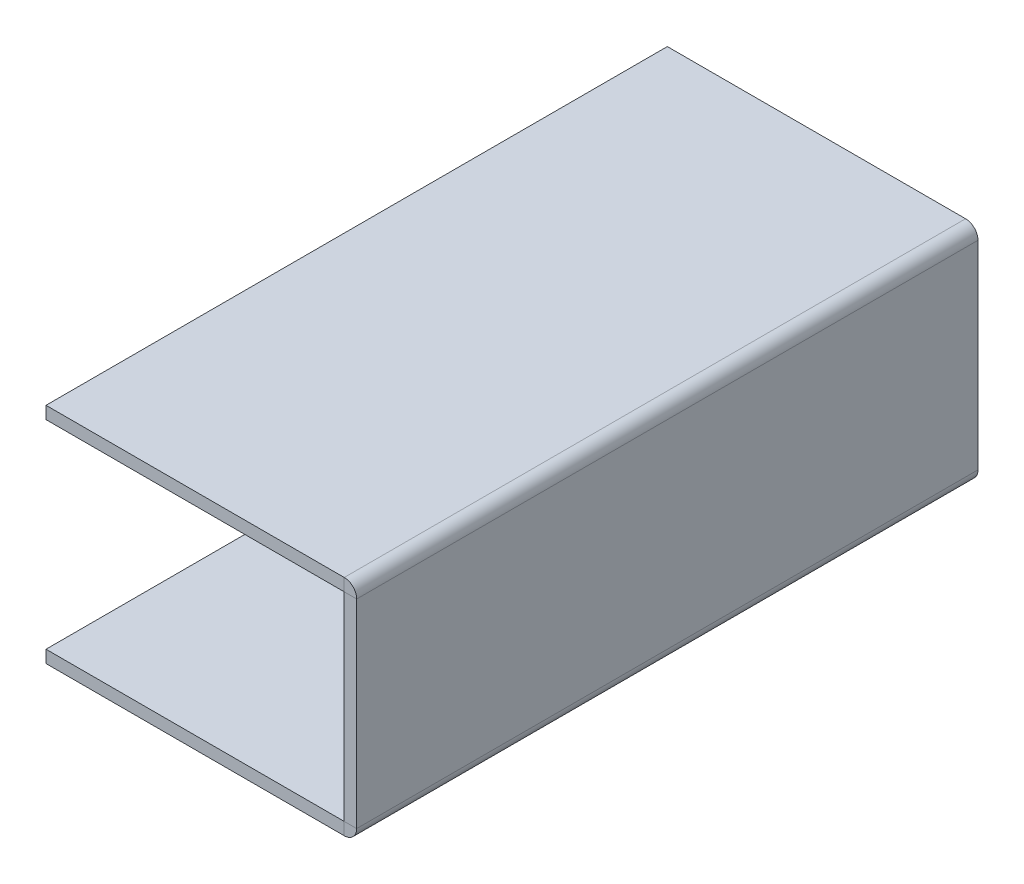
ISO-10303-21;
HEADER;
FILE_DESCRIPTION(('STEP AP214'),'2;1');
FILE_NAME('part.step','',(''),(''),'','','');
FILE_SCHEMA(('AUTOMOTIVE_DESIGN { 1 0 10303 214 1 1 1 1 }'));
ENDSEC;
DATA;
#1=APPLICATION_CONTEXT('core data for automotive mechanical design processes');
#2=APPLICATION_PROTOCOL_DEFINITION('international standard','automotive_design',2000,#1);
#3=PRODUCT_CONTEXT('',#1,'mechanical');
#4=PRODUCT('Part','Part','',(#3));
#5=PRODUCT_RELATED_PRODUCT_CATEGORY('part','',(#4));
#6=PRODUCT_DEFINITION_FORMATION('','',#4);
#7=PRODUCT_DEFINITION_CONTEXT('part definition',#1,'design');
#8=PRODUCT_DEFINITION('design','',#6,#7);
#9=PRODUCT_DEFINITION_SHAPE('','',#8);
#10=(LENGTH_UNIT() NAMED_UNIT(*) SI_UNIT(.MILLI.,.METRE.));
#11=(NAMED_UNIT(*) PLANE_ANGLE_UNIT() SI_UNIT($,.RADIAN.));
#12=(NAMED_UNIT(*) SI_UNIT($,.STERADIAN.) SOLID_ANGLE_UNIT());
#13=UNCERTAINTY_MEASURE_WITH_UNIT(LENGTH_MEASURE(1.E-05),#10,'distance_accuracy_value','');
#14=(GEOMETRIC_REPRESENTATION_CONTEXT(3) GLOBAL_UNCERTAINTY_ASSIGNED_CONTEXT((#13)) GLOBAL_UNIT_ASSIGNED_CONTEXT((#10,
#11,#12)) REPRESENTATION_CONTEXT('',''));
#15=CARTESIAN_POINT('',(0.,0.,0.));
#16=DIRECTION('',(0.,0.,1.));
#17=DIRECTION('',(1.,0.,0.));
#18=AXIS2_PLACEMENT_3D('',#15,#16,#17);
#19=CARTESIAN_POINT('',(24.0001000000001,24.0000727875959,-50.));
#20=DIRECTION('',(-1.,0.,0.));
#21=DIRECTION('',(0.,0.,-1.));
#22=AXIS2_PLACEMENT_3D('',#19,#20,#21);
#23=PLANE('',#22);
#24=DIRECTION('',(0.,1.,0.));
#25=VECTOR('',#24,1.);
#26=CARTESIAN_POINT('',(24.0001000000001,24.0000727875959,-50.));
#27=LINE('',#26,#25);
#28=CARTESIAN_POINT('',(24.0000999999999,-15.9999272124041,-50.));
#29=VERTEX_POINT('',#28);
#30=CARTESIAN_POINT('',(24.0001,-9.99999999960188E-05,-50.));
#31=VERTEX_POINT('',#30);
#32=EDGE_CURVE('E58',#29,#31,#27,.T.);
#33=ORIENTED_EDGE('',*,*,#32,.F.);
#34=DIRECTION('',(0.,0.,1.));
#35=VECTOR('',#34,1.);
#36=CARTESIAN_POINT('',(24.0000999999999,-15.9999272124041,-50.));
#37=LINE('',#36,#35);
#38=CARTESIAN_POINT('',(24.0001,-15.9999272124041,0.));
#39=VERTEX_POINT('',#38);
#40=EDGE_CURVE('E50',#29,#39,#37,.T.);
#41=ORIENTED_EDGE('',*,*,#40,.T.);
#42=DIRECTION('',(0.,-1.,0.));
#43=VECTOR('',#42,1.);
#44=CARTESIAN_POINT('',(24.0001000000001,24.000072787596,0.));
#45=LINE('',#44,#43);
#46=CARTESIAN_POINT('',(24.0001,-9.99999999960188E-05,0.));
#47=VERTEX_POINT('',#46);
#48=EDGE_CURVE('E66',#47,#39,#45,.T.);
#49=ORIENTED_EDGE('',*,*,#48,.F.);
#50=DIRECTION('',(0.,0.,1.));
#51=VECTOR('',#50,1.);
#52=CARTESIAN_POINT('',(24.0001,-9.99999999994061E-05,-50.));
#53=LINE('',#52,#51);
#54=EDGE_CURVE('E226',#31,#47,#53,.T.);
#55=ORIENTED_EDGE('',*,*,#54,.F.);
#56=EDGE_LOOP('',(#33,#41,#49,#55));
#57=FACE_BOUND('',#56,.T.);
#58=ADVANCED_FACE('F41',(#57),#23,.T.);
#59=CARTESIAN_POINT('',(25.0001000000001,24.000072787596,0.));
#60=DIRECTION('',(0.,0.,-1.));
#61=DIRECTION('',(0.,1.,0.));
#62=AXIS2_PLACEMENT_3D('',#59,#60,#61);
#63=PLANE('',#62);
#64=DIRECTION('',(-1.,0.,0.));
#65=VECTOR('',#64,1.);
#66=CARTESIAN_POINT('',(25.0001,-15.9999272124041,0.));
#67=LINE('',#66,#65);
#68=CARTESIAN_POINT('',(25.0001,-15.9999272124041,0.));
#69=VERTEX_POINT('',#68);
#70=EDGE_CURVE('E233',#69,#39,#67,.T.);
#71=ORIENTED_EDGE('',*,*,#70,.F.);
#72=DIRECTION('',(0.,-1.,0.));
#73=VECTOR('',#72,1.);
#74=CARTESIAN_POINT('',(25.0001000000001,24.000072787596,0.));
#75=LINE('',#74,#73);
#76=CARTESIAN_POINT('',(25.0001,-0.000100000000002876,0.));
#77=VERTEX_POINT('',#76);
#78=EDGE_CURVE('E238',#77,#69,#75,.T.);
#79=ORIENTED_EDGE('',*,*,#78,.F.);
#80=DIRECTION('',(-1.,0.,0.));
#81=VECTOR('',#80,1.);
#82=CARTESIAN_POINT('',(25.0001,-0.000100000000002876,0.));
#83=LINE('',#82,#81);
#84=EDGE_CURVE('E228',#77,#47,#83,.T.);
#85=ORIENTED_EDGE('',*,*,#84,.T.);
#86=ORIENTED_EDGE('',*,*,#48,.T.);
#87=EDGE_LOOP('',(#71,#79,#85,#86));
#88=FACE_BOUND('',#87,.T.);
#89=ADVANCED_FACE('F286',(#88),#63,.F.);
#90=CARTESIAN_POINT('',(25.0001000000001,24.0000727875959,-50.));
#91=DIRECTION('',(0.,0.,1.));
#92=DIRECTION('',(0.,-1.,0.));
#93=AXIS2_PLACEMENT_3D('',#90,#91,#92);
#94=PLANE('',#93);
#95=DIRECTION('',(1.,0.,0.));
#96=VECTOR('',#95,1.);
#97=CARTESIAN_POINT('',(25.0000999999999,-15.9999272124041,-50.));
#98=LINE('',#97,#96);
#99=CARTESIAN_POINT('',(25.0000999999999,-15.9999272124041,-50.));
#100=VERTEX_POINT('',#99);
#101=EDGE_CURVE('E12',#29,#100,#98,.T.);
#102=ORIENTED_EDGE('',*,*,#101,.F.);
#103=ORIENTED_EDGE('',*,*,#32,.T.);
#104=DIRECTION('',(1.,0.,0.));
#105=VECTOR('',#104,1.);
#106=CARTESIAN_POINT('',(25.0001,-0.000100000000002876,-50.));
#107=LINE('',#106,#105);
#108=CARTESIAN_POINT('',(25.0001,-9.99999596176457E-05,-50.));
#109=VERTEX_POINT('',#108);
#110=EDGE_CURVE('E223',#31,#109,#107,.T.);
#111=ORIENTED_EDGE('',*,*,#110,.T.);
#112=DIRECTION('',(0.,1.,0.));
#113=VECTOR('',#112,1.);
#114=CARTESIAN_POINT('',(25.0001000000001,24.0000727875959,-50.));
#115=LINE('',#114,#113);
#116=EDGE_CURVE('E45',#100,#109,#115,.T.);
#117=ORIENTED_EDGE('',*,*,#116,.F.);
#118=EDGE_LOOP('',(#102,#103,#111,#117));
#119=FACE_BOUND('',#118,.T.);
#120=ADVANCED_FACE('F43',(#119),#94,.F.);
#121=CARTESIAN_POINT('',(25.0001000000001,24.0000727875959,-50.));
#122=DIRECTION('',(-1.,0.,0.));
#123=DIRECTION('',(0.,0.,-1.));
#124=AXIS2_PLACEMENT_3D('',#121,#122,#123);
#125=PLANE('',#124);
#126=DIRECTION('',(0.,0.,1.));
#127=VECTOR('',#126,1.);
#128=CARTESIAN_POINT('',(25.0000999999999,-15.9999272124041,-50.));
#129=LINE('',#128,#127);
#130=EDGE_CURVE('E230',#100,#69,#129,.T.);
#131=ORIENTED_EDGE('',*,*,#130,.F.);
#132=ORIENTED_EDGE('',*,*,#116,.T.);
#133=DIRECTION('',(0.,0.,1.));
#134=VECTOR('',#133,1.);
#135=CARTESIAN_POINT('',(25.0001,-0.000100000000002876,-50.));
#136=LINE('',#135,#134);
#137=EDGE_CURVE('E220',#109,#77,#136,.T.);
#138=ORIENTED_EDGE('',*,*,#137,.T.);
#139=ORIENTED_EDGE('',*,*,#78,.T.);
#140=EDGE_LOOP('',(#131,#132,#138,#139));
#141=FACE_BOUND('',#140,.T.);
#142=ADVANCED_FACE('F243',(#141),#125,.F.);
#143=CARTESIAN_POINT('',(0.,1.,0.));
#144=DIRECTION('',(1.,0.,0.));
#145=DIRECTION('',(0.,0.,-1.));
#146=AXIS2_PLACEMENT_3D('',#143,#144,#145);
#147=PLANE('',#146);
#148=DIRECTION('',(0.,0.,1.));
#149=VECTOR('',#148,1.);
#150=CARTESIAN_POINT('',(0.,0.,0.));
#151=LINE('',#150,#149);
#152=CARTESIAN_POINT('',(0.,0.,-50.));
#153=VERTEX_POINT('',#152);
#154=CARTESIAN_POINT('',(0.,0.,0.));
#155=VERTEX_POINT('',#154);
#156=EDGE_CURVE('E209',#153,#155,#151,.T.);
#157=ORIENTED_EDGE('',*,*,#156,.T.);
#158=DIRECTION('',(0.,-1.,0.));
#159=VECTOR('',#158,1.);
#160=CARTESIAN_POINT('',(0.,1.,0.));
#161=LINE('',#160,#159);
#162=CARTESIAN_POINT('',(0.,1.,0.));
#163=VERTEX_POINT('',#162);
#164=EDGE_CURVE('E191',#163,#155,#161,.T.);
#165=ORIENTED_EDGE('',*,*,#164,.F.);
#166=DIRECTION('',(0.,0.,1.));
#167=VECTOR('',#166,1.);
#168=CARTESIAN_POINT('',(0.,1.,0.));
#169=LINE('',#168,#167);
#170=CARTESIAN_POINT('',(0.,1.,-50.));
#171=VERTEX_POINT('',#170);
#172=EDGE_CURVE('E201',#171,#163,#169,.T.);
#173=ORIENTED_EDGE('',*,*,#172,.F.);
#174=DIRECTION('',(0.,-1.,0.));
#175=VECTOR('',#174,1.);
#176=CARTESIAN_POINT('',(0.,1.,-50.));
#177=LINE('',#176,#175);
#178=EDGE_CURVE('E206',#171,#153,#177,.T.);
#179=ORIENTED_EDGE('',*,*,#178,.T.);
#180=EDGE_LOOP('',(#157,#165,#173,#179));
#181=FACE_BOUND('',#180,.T.);
#182=ADVANCED_FACE('F275',(#181),#147,.F.);
#183=CARTESIAN_POINT('',(0.,1.,-50.));
#184=DIRECTION('',(0.,-1.,0.));
#185=DIRECTION('',(0.,0.,-1.));
#186=AXIS2_PLACEMENT_3D('',#183,#184,#185);
#187=PLANE('',#186);
#188=DIRECTION('',(0.,0.,1.));
#189=VECTOR('',#188,1.);
#190=CARTESIAN_POINT('',(24.,1.,-50.));
#191=LINE('',#190,#189);
#192=CARTESIAN_POINT('',(24.,1.,-50.));
#193=VERTEX_POINT('',#192);
#194=CARTESIAN_POINT('',(24.,1.,0.));
#195=VERTEX_POINT('',#194);
#196=EDGE_CURVE('E184',#193,#195,#191,.T.);
#197=ORIENTED_EDGE('',*,*,#196,.F.);
#198=DIRECTION('',(-1.,0.,0.));
#199=VECTOR('',#198,1.);
#200=CARTESIAN_POINT('',(0.,1.,-50.));
#201=LINE('',#200,#199);
#202=EDGE_CURVE('E204',#193,#171,#201,.T.);
#203=ORIENTED_EDGE('',*,*,#202,.T.);
#204=ORIENTED_EDGE('',*,*,#172,.T.);
#205=DIRECTION('',(1.,0.,0.));
#206=VECTOR('',#205,1.);
#207=CARTESIAN_POINT('',(0.,1.,0.));
#208=LINE('',#207,#206);
#209=EDGE_CURVE('E199',#163,#195,#208,.T.);
#210=ORIENTED_EDGE('',*,*,#209,.T.);
#211=EDGE_LOOP('',(#197,#203,#204,#210));
#212=FACE_BOUND('',#211,.T.);
#213=ADVANCED_FACE('F268',(#212),#187,.F.);
#214=CARTESIAN_POINT('',(0.,1.,-50.));
#215=DIRECTION('',(0.,0.,1.));
#216=DIRECTION('',(1.,0.,0.));
#217=AXIS2_PLACEMENT_3D('',#214,#215,#216);
#218=PLANE('',#217);
#219=DIRECTION('',(0.,1.,0.));
#220=VECTOR('',#219,1.);
#221=CARTESIAN_POINT('',(24.,1.,-50.));
#222=LINE('',#221,#220);
#223=CARTESIAN_POINT('',(24.,0.,-50.));
#224=VERTEX_POINT('',#223);
#225=EDGE_CURVE('E212',#224,#193,#222,.T.);
#226=ORIENTED_EDGE('',*,*,#225,.F.);
#227=DIRECTION('',(-1.,0.,0.));
#228=VECTOR('',#227,1.);
#229=CARTESIAN_POINT('',(0.,0.,-50.));
#230=LINE('',#229,#228);
#231=EDGE_CURVE('E197',#224,#153,#230,.T.);
#232=ORIENTED_EDGE('',*,*,#231,.T.);
#233=ORIENTED_EDGE('',*,*,#178,.F.);
#234=ORIENTED_EDGE('',*,*,#202,.F.);
#235=EDGE_LOOP('',(#226,#232,#233,#234));
#236=FACE_BOUND('',#235,.T.);
#237=ADVANCED_FACE('F271',(#236),#218,.F.);
#238=CARTESIAN_POINT('',(0.,0.,-50.));
#239=DIRECTION('',(0.,-1.,0.));
#240=DIRECTION('',(0.,0.,-1.));
#241=AXIS2_PLACEMENT_3D('',#238,#239,#240);
#242=PLANE('',#241);
#243=ORIENTED_EDGE('',*,*,#231,.F.);
#244=DIRECTION('',(0.,0.,1.));
#245=VECTOR('',#244,1.);
#246=CARTESIAN_POINT('',(24.,0.,-50.));
#247=LINE('',#246,#245);
#248=CARTESIAN_POINT('',(24.,0.,0.));
#249=VERTEX_POINT('',#248);
#250=EDGE_CURVE('E194',#224,#249,#247,.T.);
#251=ORIENTED_EDGE('',*,*,#250,.T.);
#252=DIRECTION('',(1.,0.,0.));
#253=VECTOR('',#252,1.);
#254=CARTESIAN_POINT('',(0.,0.,0.));
#255=LINE('',#254,#253);
#256=EDGE_CURVE('E189',#155,#249,#255,.T.);
#257=ORIENTED_EDGE('',*,*,#256,.F.);
#258=ORIENTED_EDGE('',*,*,#156,.F.);
#259=EDGE_LOOP('',(#243,#251,#257,#258));
#260=FACE_BOUND('',#259,.T.);
#261=ADVANCED_FACE('F254',(#260),#242,.T.);
#262=CARTESIAN_POINT('',(0.,1.,0.));
#263=DIRECTION('',(0.,0.,-1.));
#264=DIRECTION('',(-1.,0.,0.));
#265=AXIS2_PLACEMENT_3D('',#262,#263,#264);
#266=PLANE('',#265);
#267=DIRECTION('',(0.,-1.,0.));
#268=VECTOR('',#267,1.);
#269=CARTESIAN_POINT('',(24.,1.,0.));
#270=LINE('',#269,#268);
#271=EDGE_CURVE('E215',#195,#249,#270,.T.);
#272=ORIENTED_EDGE('',*,*,#271,.F.);
#273=ORIENTED_EDGE('',*,*,#209,.F.);
#274=ORIENTED_EDGE('',*,*,#164,.T.);
#275=ORIENTED_EDGE('',*,*,#256,.T.);
#276=EDGE_LOOP('',(#272,#273,#274,#275));
#277=FACE_BOUND('',#276,.T.);
#278=ADVANCED_FACE('F263',(#277),#266,.F.);
#279=CARTESIAN_POINT('',(24.,-0.000100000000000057,-50.));
#280=DIRECTION('',(0.,0.,-1.));
#281=DIRECTION('',(-1.,0.,0.));
#282=AXIS2_PLACEMENT_3D('',#279,#280,#281);
#283=PLANE('',#282);
#284=ORIENTED_EDGE('',*,*,#110,.F.);
#285=CARTESIAN_POINT('',(24.,-0.000100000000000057,-50.));
#286=DIRECTION('',(0.,0.,-1.));
#287=DIRECTION('',(-1.,0.,0.));
#288=AXIS2_PLACEMENT_3D('',#285,#286,#287);
#289=CIRCLE('',#288,0.000100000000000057);
#290=EDGE_CURVE('E171',#31,#224,#289,.F.);
#291=ORIENTED_EDGE('',*,*,#290,.T.);
#292=ORIENTED_EDGE('',*,*,#225,.T.);
#293=CARTESIAN_POINT('',(24.,-0.000100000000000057,-50.));
#294=DIRECTION('',(0.,0.,1.));
#295=DIRECTION('',(1.,0.,0.));
#296=AXIS2_PLACEMENT_3D('',#293,#294,#295);
#297=CIRCLE('',#296,1.0001);
#298=EDGE_CURVE('E178',#109,#193,#297,.T.);
#299=ORIENTED_EDGE('',*,*,#298,.F.);
#300=EDGE_LOOP('',(#284,#291,#292,#299));
#301=FACE_BOUND('',#300,.T.);
#302=ADVANCED_FACE('F248',(#301),#283,.T.);
#303=CARTESIAN_POINT('',(24.,-0.000100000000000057,0.));
#304=DIRECTION('',(0.,0.,1.));
#305=DIRECTION('',(1.,0.,0.));
#306=AXIS2_PLACEMENT_3D('',#303,#304,#305);
#307=PLANE('',#306);
#308=CARTESIAN_POINT('',(24.,-0.000100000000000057,0.));
#309=DIRECTION('',(0.,0.,-1.));
#310=DIRECTION('',(-1.,0.,0.));
#311=AXIS2_PLACEMENT_3D('',#308,#309,#310);
#312=CIRCLE('',#311,0.000100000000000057);
#313=EDGE_CURVE('E182',#249,#47,#312,.T.);
#314=ORIENTED_EDGE('',*,*,#313,.T.);
#315=ORIENTED_EDGE('',*,*,#84,.F.);
#316=CARTESIAN_POINT('',(24.,-0.000100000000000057,0.));
#317=DIRECTION('',(0.,0.,-1.));
#318=DIRECTION('',(-1.,0.,0.));
#319=AXIS2_PLACEMENT_3D('',#316,#317,#318);
#320=CIRCLE('',#319,1.0001);
#321=EDGE_CURVE('E181',#195,#77,#320,.T.);
#322=ORIENTED_EDGE('',*,*,#321,.F.);
#323=ORIENTED_EDGE('',*,*,#271,.T.);
#324=EDGE_LOOP('',(#314,#315,#322,#323));
#325=FACE_BOUND('',#324,.T.);
#326=ADVANCED_FACE('F260',(#325),#307,.T.);
#327=CARTESIAN_POINT('',(24.,-0.000100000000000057,25.0099990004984));
#328=DIRECTION('',(0.,0.,-1.));
#329=DIRECTION('',(-1.,0.,0.));
#330=AXIS2_PLACEMENT_3D('',#327,#328,#329);
#331=CYLINDRICAL_SURFACE('',#330,1.0001);
#332=ORIENTED_EDGE('',*,*,#196,.T.);
#333=ORIENTED_EDGE('',*,*,#321,.T.);
#334=ORIENTED_EDGE('',*,*,#137,.F.);
#335=ORIENTED_EDGE('',*,*,#298,.T.);
#336=EDGE_LOOP('',(#332,#333,#334,#335));
#337=FACE_BOUND('',#336,.T.);
#338=ADVANCED_FACE('F266',(#337),#331,.T.);
#339=CARTESIAN_POINT('',(24.,-0.000100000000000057,25.0099990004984));
#340=DIRECTION('',(0.,0.,-1.));
#341=DIRECTION('',(-1.,0.,0.));
#342=AXIS2_PLACEMENT_3D('',#339,#340,#341);
#343=CYLINDRICAL_SURFACE('',#342,0.000100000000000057);
#344=ORIENTED_EDGE('',*,*,#250,.F.);
#345=ORIENTED_EDGE('',*,*,#290,.F.);
#346=ORIENTED_EDGE('',*,*,#54,.T.);
#347=ORIENTED_EDGE('',*,*,#313,.F.);
#348=EDGE_LOOP('',(#344,#345,#346,#347));
#349=FACE_BOUND('',#348,.T.);
#350=ADVANCED_FACE('F251',(#349),#343,.F.);
#351=CARTESIAN_POINT('',(23.9999999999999,-15.9999272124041,-50.));
#352=DIRECTION('',(0.,0.,-1.));
#353=DIRECTION('',(-1.,0.,0.));
#354=AXIS2_PLACEMENT_3D('',#351,#352,#353);
#355=PLANE('',#354);
#356=DIRECTION('',(0.,-1.,0.));
#357=VECTOR('',#356,1.);
#358=CARTESIAN_POINT('',(23.9999999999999,-17.0000272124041,-50.));
#359=LINE('',#358,#357);
#360=CARTESIAN_POINT('',(23.9999999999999,-16.0000272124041,-50.));
#361=VERTEX_POINT('',#360);
#362=CARTESIAN_POINT('',(24.0000000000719,-17.0000272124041,-50.));
#363=VERTEX_POINT('',#362);
#364=EDGE_CURVE('E509',#361,#363,#359,.T.);
#365=ORIENTED_EDGE('',*,*,#364,.F.);
#366=CARTESIAN_POINT('',(23.9999999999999,-15.9999272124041,-50.));
#367=DIRECTION('',(0.,0.,-1.));
#368=DIRECTION('',(-1.,0.,0.));
#369=AXIS2_PLACEMENT_3D('',#366,#367,#368);
#370=CIRCLE('',#369,0.000100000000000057);
#371=EDGE_CURVE('E172',#361,#29,#370,.F.);
#372=ORIENTED_EDGE('',*,*,#371,.T.);
#373=ORIENTED_EDGE('',*,*,#101,.T.);
#374=CARTESIAN_POINT('',(23.9999999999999,-15.9999272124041,-50.));
#375=DIRECTION('',(0.,0.,1.));
#376=DIRECTION('',(1.,0.,0.));
#377=AXIS2_PLACEMENT_3D('',#374,#375,#376);
#378=CIRCLE('',#377,1.0001);
#379=EDGE_CURVE('E164',#363,#100,#378,.T.);
#380=ORIENTED_EDGE('',*,*,#379,.F.);
#381=EDGE_LOOP('',(#365,#372,#373,#380));
#382=FACE_BOUND('',#381,.T.);
#383=ADVANCED_FACE('F332',(#382),#355,.T.);
#384=CARTESIAN_POINT('',(23.9999999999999,-15.9999272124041,0.));
#385=DIRECTION('',(0.,0.,1.));
#386=DIRECTION('',(1.,0.,0.));
#387=AXIS2_PLACEMENT_3D('',#384,#385,#386);
#388=PLANE('',#387);
#389=CARTESIAN_POINT('',(23.9999999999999,-15.9999272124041,0.));
#390=DIRECTION('',(0.,0.,-1.));
#391=DIRECTION('',(-1.,0.,0.));
#392=AXIS2_PLACEMENT_3D('',#389,#390,#391);
#393=CIRCLE('',#392,0.000100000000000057);
#394=CARTESIAN_POINT('',(24.,-16.0000272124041,0.));
#395=VERTEX_POINT('',#394);
#396=EDGE_CURVE('E168',#39,#395,#393,.T.);
#397=ORIENTED_EDGE('',*,*,#396,.T.);
#398=DIRECTION('',(0.,1.,0.));
#399=VECTOR('',#398,1.);
#400=CARTESIAN_POINT('',(23.9999999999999,-17.0000272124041,0.));
#401=LINE('',#400,#399);
#402=CARTESIAN_POINT('',(23.9999999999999,-17.0000272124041,0.));
#403=VERTEX_POINT('',#402);
#404=EDGE_CURVE('E142',#403,#395,#401,.T.);
#405=ORIENTED_EDGE('',*,*,#404,.F.);
#406=CARTESIAN_POINT('',(23.9999999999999,-15.9999272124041,0.));
#407=DIRECTION('',(0.,0.,-1.));
#408=DIRECTION('',(-1.,0.,0.));
#409=AXIS2_PLACEMENT_3D('',#406,#407,#408);
#410=CIRCLE('',#409,1.0001);
#411=EDGE_CURVE('E167',#69,#403,#410,.T.);
#412=ORIENTED_EDGE('',*,*,#411,.F.);
#413=ORIENTED_EDGE('',*,*,#70,.T.);
#414=EDGE_LOOP('',(#397,#405,#412,#413));
#415=FACE_BOUND('',#414,.T.);
#416=ADVANCED_FACE('F339',(#415),#388,.T.);
#417=CARTESIAN_POINT('',(24.,-15.9999272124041,25.0099990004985));
#418=DIRECTION('',(0.,0.,-1.));
#419=DIRECTION('',(-1.,0.,0.));
#420=AXIS2_PLACEMENT_3D('',#417,#418,#419);
#421=CYLINDRICAL_SURFACE('',#420,1.0001);
#422=ORIENTED_EDGE('',*,*,#130,.T.);
#423=ORIENTED_EDGE('',*,*,#411,.T.);
#424=DIRECTION('',(0.,0.,1.));
#425=VECTOR('',#424,1.);
#426=CARTESIAN_POINT('',(23.9999999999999,-17.0000272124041,-50.));
#427=LINE('',#426,#425);
#428=EDGE_CURVE('E519',#363,#403,#427,.T.);
#429=ORIENTED_EDGE('',*,*,#428,.F.);
#430=ORIENTED_EDGE('',*,*,#379,.T.);
#431=EDGE_LOOP('',(#422,#423,#429,#430));
#432=FACE_BOUND('',#431,.T.);
#433=ADVANCED_FACE('F342',(#432),#421,.T.);
#434=CARTESIAN_POINT('',(24.,-15.9999272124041,25.0099990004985));
#435=DIRECTION('',(0.,0.,-1.));
#436=DIRECTION('',(-1.,0.,0.));
#437=AXIS2_PLACEMENT_3D('',#434,#435,#436);
#438=CYLINDRICAL_SURFACE('',#437,0.000100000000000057);
#439=ORIENTED_EDGE('',*,*,#40,.F.);
#440=ORIENTED_EDGE('',*,*,#371,.F.);
#441=DIRECTION('',(0.,0.,1.));
#442=VECTOR('',#441,1.);
#443=CARTESIAN_POINT('',(23.9999999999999,-16.0000272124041,-50.));
#444=LINE('',#443,#442);
#445=EDGE_CURVE('E159',#361,#395,#444,.T.);
#446=ORIENTED_EDGE('',*,*,#445,.T.);
#447=ORIENTED_EDGE('',*,*,#396,.F.);
#448=EDGE_LOOP('',(#439,#440,#446,#447));
#449=FACE_BOUND('',#448,.T.);
#450=ADVANCED_FACE('F350',(#449),#438,.F.);
#451=CARTESIAN_POINT('',(0.000172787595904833,-17.0000272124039,0.));
#452=DIRECTION('',(1.,0.,0.));
#453=DIRECTION('',(0.,0.,1.));
#454=AXIS2_PLACEMENT_3D('',#451,#452,#453);
#455=PLANE('',#454);
#456=DIRECTION('',(0.,0.,-1.));
#457=VECTOR('',#456,1.);
#458=CARTESIAN_POINT('',(0.000172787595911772,-16.0000272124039,0.));
#459=LINE('',#458,#457);
#460=CARTESIAN_POINT('',(0.000172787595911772,-16.0000272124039,0.));
#461=VERTEX_POINT('',#460);
#462=CARTESIAN_POINT('',(0.000172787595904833,-16.0000272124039,-50.));
#463=VERTEX_POINT('',#462);
#464=EDGE_CURVE('E152',#461,#463,#459,.T.);
#465=ORIENTED_EDGE('',*,*,#464,.T.);
#466=DIRECTION('',(0.,1.,0.));
#467=VECTOR('',#466,1.);
#468=CARTESIAN_POINT('',(0.000172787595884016,-17.0000272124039,-50.));
#469=LINE('',#468,#467);
#470=CARTESIAN_POINT('',(0.000172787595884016,-17.0000272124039,-50.));
#471=VERTEX_POINT('',#470);
#472=EDGE_CURVE('E175',#471,#463,#469,.T.);
#473=ORIENTED_EDGE('',*,*,#472,.F.);
#474=DIRECTION('',(0.,0.,-1.));
#475=VECTOR('',#474,1.);
#476=CARTESIAN_POINT('',(0.000172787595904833,-17.0000272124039,0.));
#477=LINE('',#476,#475);
#478=CARTESIAN_POINT('',(0.000172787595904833,-17.0000272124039,0.));
#479=VERTEX_POINT('',#478);
#480=EDGE_CURVE('E154',#479,#471,#477,.T.);
#481=ORIENTED_EDGE('',*,*,#480,.F.);
#482=DIRECTION('',(0.,1.,0.));
#483=VECTOR('',#482,1.);
#484=CARTESIAN_POINT('',(0.000172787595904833,-17.0000272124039,0.));
#485=LINE('',#484,#483);
#486=EDGE_CURVE('E139',#479,#461,#485,.T.);
#487=ORIENTED_EDGE('',*,*,#486,.T.);
#488=EDGE_LOOP('',(#465,#473,#481,#487));
#489=FACE_BOUND('',#488,.T.);
#490=ADVANCED_FACE('F150',(#489),#455,.F.);
#491=CARTESIAN_POINT('',(64.0001727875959,-17.0000272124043,-50.));
#492=DIRECTION('',(0.,1.,0.));
#493=DIRECTION('',(0.,0.,-1.));
#494=AXIS2_PLACEMENT_3D('',#491,#492,#493);
#495=PLANE('',#494);
#496=DIRECTION('',(1.,0.,0.));
#497=VECTOR('',#496,1.);
#498=CARTESIAN_POINT('',(64.0001727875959,-17.0000272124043,-50.));
#499=LINE('',#498,#497);
#500=EDGE_CURVE('E155',#471,#363,#499,.T.);
#501=ORIENTED_EDGE('',*,*,#500,.T.);
#502=ORIENTED_EDGE('',*,*,#428,.T.);
#503=DIRECTION('',(-1.,0.,0.));
#504=VECTOR('',#503,1.);
#505=CARTESIAN_POINT('',(64.0001727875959,-17.0000272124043,0.));
#506=LINE('',#505,#504);
#507=EDGE_CURVE('E520',#403,#479,#506,.T.);
#508=ORIENTED_EDGE('',*,*,#507,.T.);
#509=ORIENTED_EDGE('',*,*,#480,.T.);
#510=EDGE_LOOP('',(#501,#502,#508,#509));
#511=FACE_BOUND('',#510,.T.);
#512=ADVANCED_FACE('F370',(#511),#495,.F.);
#513=CARTESIAN_POINT('',(64.0001727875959,-17.0000272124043,0.));
#514=DIRECTION('',(0.,0.,-1.));
#515=DIRECTION('',(1.,0.,0.));
#516=AXIS2_PLACEMENT_3D('',#513,#514,#515);
#517=PLANE('',#516);
#518=ORIENTED_EDGE('',*,*,#507,.F.);
#519=ORIENTED_EDGE('',*,*,#404,.T.);
#520=DIRECTION('',(-1.,0.,0.));
#521=VECTOR('',#520,1.);
#522=CARTESIAN_POINT('',(64.0001727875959,-16.0000272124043,0.));
#523=LINE('',#522,#521);
#524=EDGE_CURVE('E135',#395,#461,#523,.T.);
#525=ORIENTED_EDGE('',*,*,#524,.T.);
#526=ORIENTED_EDGE('',*,*,#486,.F.);
#527=EDGE_LOOP('',(#518,#519,#525,#526));
#528=FACE_BOUND('',#527,.T.);
#529=ADVANCED_FACE('F138',(#528),#517,.F.);
#530=CARTESIAN_POINT('',(64.0001727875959,-16.0000272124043,-50.));
#531=DIRECTION('',(0.,1.,0.));
#532=DIRECTION('',(0.,0.,-1.));
#533=AXIS2_PLACEMENT_3D('',#530,#531,#532);
#534=PLANE('',#533);
#535=ORIENTED_EDGE('',*,*,#445,.F.);
#536=DIRECTION('',(1.,0.,0.));
#537=VECTOR('',#536,1.);
#538=CARTESIAN_POINT('',(64.0001727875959,-16.0000272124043,-50.));
#539=LINE('',#538,#537);
#540=EDGE_CURVE('E147',#463,#361,#539,.T.);
#541=ORIENTED_EDGE('',*,*,#540,.F.);
#542=ORIENTED_EDGE('',*,*,#464,.F.);
#543=ORIENTED_EDGE('',*,*,#524,.F.);
#544=EDGE_LOOP('',(#535,#541,#542,#543));
#545=FACE_BOUND('',#544,.T.);
#546=ADVANCED_FACE('F158',(#545),#534,.T.);
#547=CARTESIAN_POINT('',(64.0001727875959,-17.0000272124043,-50.));
#548=DIRECTION('',(0.,0.,1.));
#549=DIRECTION('',(-1.,0.,0.));
#550=AXIS2_PLACEMENT_3D('',#547,#548,#549);
#551=PLANE('',#550);
#552=ORIENTED_EDGE('',*,*,#540,.T.);
#553=ORIENTED_EDGE('',*,*,#364,.T.);
#554=ORIENTED_EDGE('',*,*,#500,.F.);
#555=ORIENTED_EDGE('',*,*,#472,.T.);
#556=EDGE_LOOP('',(#552,#553,#554,#555));
#557=FACE_BOUND('',#556,.T.);
#558=ADVANCED_FACE('F390',(#557),#551,.F.);
#559=CLOSED_SHELL('',(#58,#89,#120,#142,#182,#213,#237,#261,#278,#302,#326,#338,#350,#383,#416,
#433,#450,#490,#512,#529,#546,#558));
#560=MANIFOLD_SOLID_BREP('B2',#559);
#561=ADVANCED_BREP_SHAPE_REPRESENTATION('',(#18,#560),#14);
#562=SHAPE_DEFINITION_REPRESENTATION(#9,#561);
ENDSEC;
END-ISO-10303-21;
